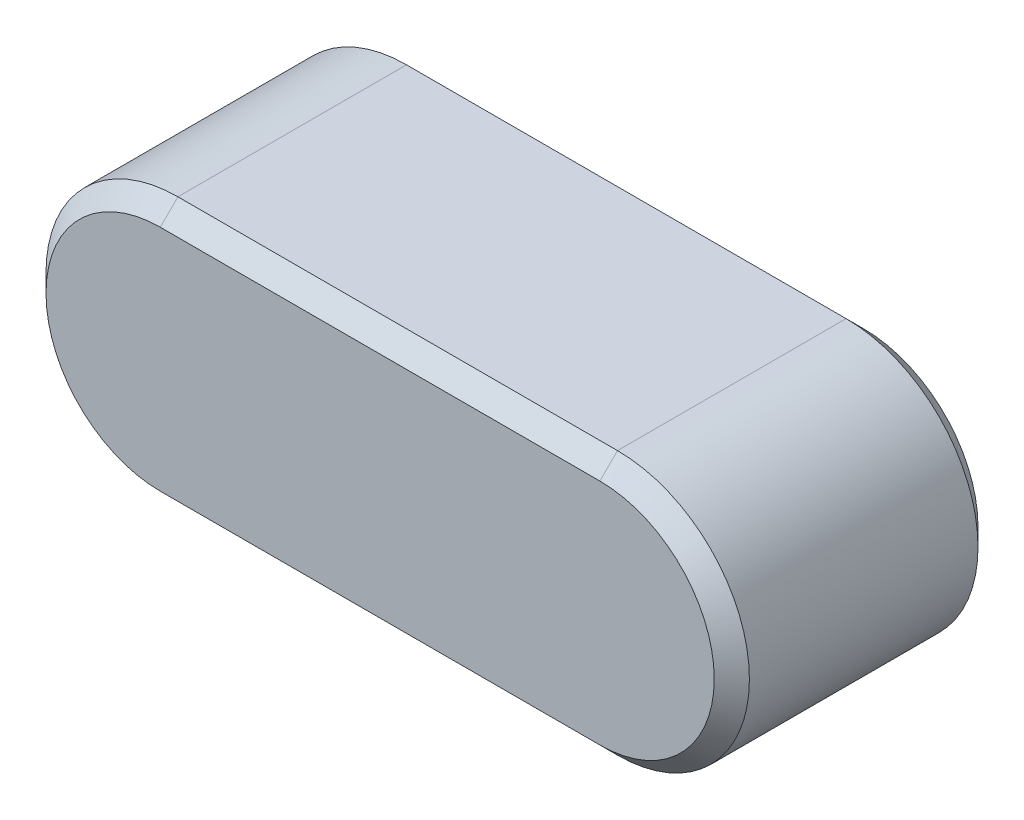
from build123d import *

# Parameters (mm, degrees)
BASEKEY_DEPTH = 1.5
CHAMFER1_SIZE = 0.2


with BuildPart() as part:
    # Sketch1 → BaseKey (new, symmetric)
    with BuildSketch(Plane.XY):
        with BuildLine():
            Line((-5, 1.5), (0, 1.5))
            ThreePointArc((0, 1.5), (1.5, 0), (0, -1.5))
            Line((0, -1.5), (-5, -1.5))
            ThreePointArc((-5, -1.5), (-6.5, 0), (-5, 1.5))
        make_face()
    extrude(amount=BASEKEY_DEPTH, both=True)

    # Chamfer1
    chamfer1_edges = [part.edges().sort_by_distance(p)[0] for p in [
        (1.5, 0, 1.5),
        (-2.5, 1.5, 1.5),
        (-6.5, 0, 1.5),
        (-2.5, 1.5, -1.5),
        (1.5, 0, -1.5),
        (-2.5, -1.5, -1.5),
        (-6.5, 0, -1.5),
        (-2.5, -1.5, 1.5),
    ]]
    chamfer(chamfer1_edges, length=CHAMFER1_SIZE)


solid = part.part
